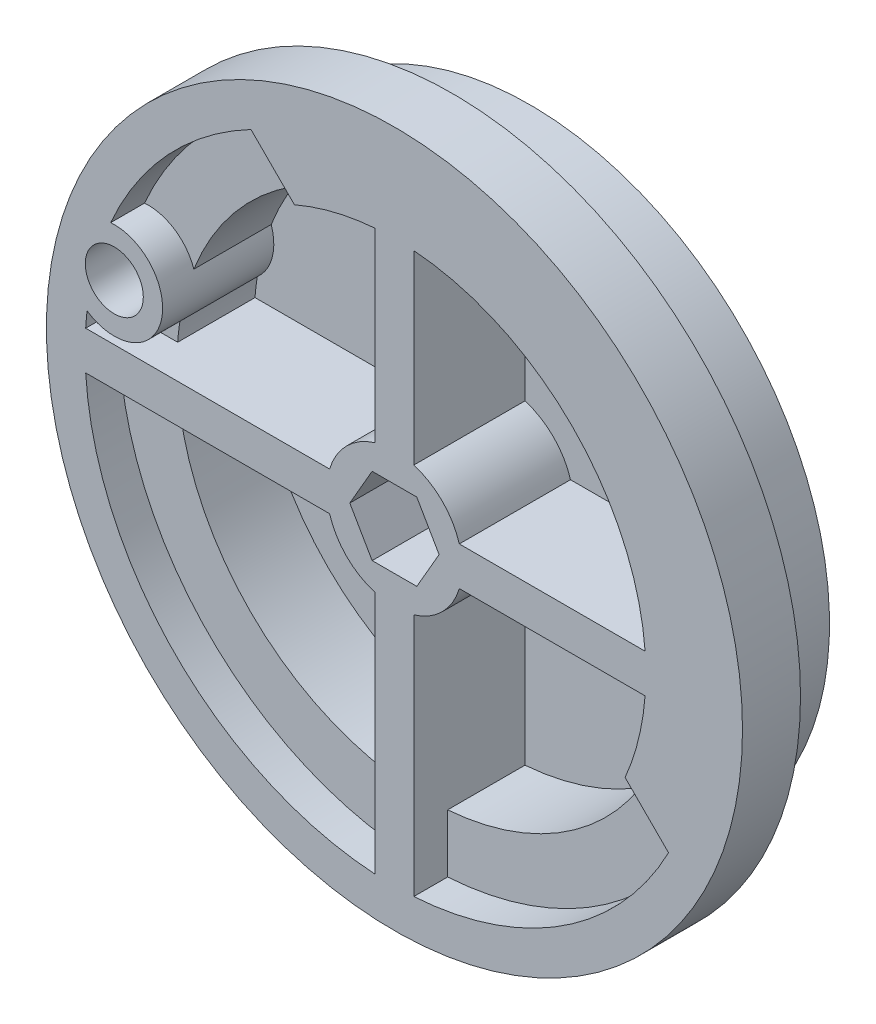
ISO-10303-21;
HEADER;
FILE_DESCRIPTION(('STEP AP214'),'2;1');
FILE_NAME('part.step','',(''),(''),'','','');
FILE_SCHEMA(('AUTOMOTIVE_DESIGN { 1 0 10303 214 1 1 1 1 }'));
ENDSEC;
DATA;
#1=APPLICATION_CONTEXT('core data for automotive mechanical design processes');
#2=APPLICATION_PROTOCOL_DEFINITION('international standard','automotive_design',2000,#1);
#3=PRODUCT_CONTEXT('',#1,'mechanical');
#4=PRODUCT('Part','Part','',(#3));
#5=PRODUCT_RELATED_PRODUCT_CATEGORY('part','',(#4));
#6=PRODUCT_DEFINITION_FORMATION('','',#4);
#7=PRODUCT_DEFINITION_CONTEXT('part definition',#1,'design');
#8=PRODUCT_DEFINITION('design','',#6,#7);
#9=PRODUCT_DEFINITION_SHAPE('','',#8);
#10=(LENGTH_UNIT() NAMED_UNIT(*) SI_UNIT(.MILLI.,.METRE.));
#11=(NAMED_UNIT(*) PLANE_ANGLE_UNIT() SI_UNIT($,.RADIAN.));
#12=(NAMED_UNIT(*) SI_UNIT($,.STERADIAN.) SOLID_ANGLE_UNIT());
#13=UNCERTAINTY_MEASURE_WITH_UNIT(LENGTH_MEASURE(1.E-05),#10,'distance_accuracy_value','');
#14=(GEOMETRIC_REPRESENTATION_CONTEXT(3) GLOBAL_UNCERTAINTY_ASSIGNED_CONTEXT((#13)) GLOBAL_UNIT_ASSIGNED_CONTEXT((#10,
#11,#12)) REPRESENTATION_CONTEXT('',''));
#15=CARTESIAN_POINT('',(0.,0.,0.));
#16=DIRECTION('',(0.,0.,1.));
#17=DIRECTION('',(1.,0.,0.));
#18=AXIS2_PLACEMENT_3D('',#15,#16,#17);
#19=CARTESIAN_POINT('',(0.,0.,4.));
#20=DIRECTION('',(0.,0.,-1.));
#21=DIRECTION('',(-1.,0.,0.));
#22=AXIS2_PLACEMENT_3D('',#19,#20,#21);
#23=CYLINDRICAL_SURFACE('',#22,15.5);
#24=DIRECTION('',(0.,0.,-1.));
#25=VECTOR('',#24,1.);
#26=CARTESIAN_POINT('',(-14.1362931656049,6.35729624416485,2.125));
#27=LINE('',#26,#25);
#28=CARTESIAN_POINT('',(-14.1362931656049,6.35729624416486,4.));
#29=VERTEX_POINT('',#28);
#30=CARTESIAN_POINT('',(-14.1362931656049,6.35729624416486,0.));
#31=VERTEX_POINT('',#30);
#32=EDGE_CURVE('E346',#29,#31,#27,.T.);
#33=ORIENTED_EDGE('',*,*,#32,.F.);
#34=CARTESIAN_POINT('',(0.,0.,4.));
#35=DIRECTION('',(0.,0.,1.));
#36=DIRECTION('',(1.,0.,0.));
#37=AXIS2_PLACEMENT_3D('',#34,#35,#36);
#38=CIRCLE('',#37,15.5);
#39=CARTESIAN_POINT('',(-15.4210371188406,1.56256653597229,4.));
#40=VERTEX_POINT('',#39);
#41=EDGE_CURVE('E552',#40,#29,#38,.T.);
#42=ORIENTED_EDGE('',*,*,#41,.F.);
#43=DIRECTION('',(0.,0.,-1.));
#44=VECTOR('',#43,1.);
#45=CARTESIAN_POINT('',(-15.4210371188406,1.5625665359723,2.125));
#46=LINE('',#45,#44);
#47=CARTESIAN_POINT('',(-15.4210371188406,1.56256653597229,0.));
#48=VERTEX_POINT('',#47);
#49=EDGE_CURVE('E343',#48,#40,#46,.F.);
#50=ORIENTED_EDGE('',*,*,#49,.F.);
#51=CARTESIAN_POINT('',(0.,0.,0.));
#52=DIRECTION('',(0.,0.,1.));
#53=DIRECTION('',(1.,0.,0.));
#54=AXIS2_PLACEMENT_3D('',#51,#52,#53);
#55=CIRCLE('',#54,15.5);
#56=EDGE_CURVE('E549',#48,#31,#55,.T.);
#57=ORIENTED_EDGE('',*,*,#56,.T.);
#58=EDGE_LOOP('',(#33,#42,#50,#57));
#59=FACE_BOUND('',#58,.T.);
#60=ADVANCED_FACE('F30',(#59),#23,.T.);
#61=CARTESIAN_POINT('',(0.,0.,0.));
#62=DIRECTION('',(0.,0.,1.));
#63=DIRECTION('',(1.,0.,0.));
#64=AXIS2_PLACEMENT_3D('',#61,#62,#63);
#65=PLANE('',#64);
#66=DIRECTION('',(-1.,0.,0.));
#67=VECTOR('',#66,1.);
#68=CARTESIAN_POINT('',(0.,2.,0.));
#69=LINE('',#68,#67);
#70=CARTESIAN_POINT('',(1.15470053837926,2.,0.));
#71=VERTEX_POINT('',#70);
#72=CARTESIAN_POINT('',(-1.15470053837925,2.,0.));
#73=VERTEX_POINT('',#72);
#74=EDGE_CURVE('E310',#71,#73,#69,.T.);
#75=ORIENTED_EDGE('',*,*,#74,.T.);
#76=DIRECTION('',(-0.499999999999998,-0.86602540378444,0.));
#77=VECTOR('',#76,1.);
#78=CARTESIAN_POINT('',(-1.73205080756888,0.999999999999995,0.));
#79=LINE('',#78,#77);
#80=CARTESIAN_POINT('',(-2.3094010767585,0.,0.));
#81=VERTEX_POINT('',#80);
#82=EDGE_CURVE('E313',#73,#81,#79,.T.);
#83=ORIENTED_EDGE('',*,*,#82,.T.);
#84=DIRECTION('',(0.499999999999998,-0.86602540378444,0.));
#85=VECTOR('',#84,1.);
#86=CARTESIAN_POINT('',(-1.73205080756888,-0.999999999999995,0.));
#87=LINE('',#86,#85);
#88=CARTESIAN_POINT('',(-1.15470053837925,-2.,0.));
#89=VERTEX_POINT('',#88);
#90=EDGE_CURVE('E295',#81,#89,#87,.T.);
#91=ORIENTED_EDGE('',*,*,#90,.T.);
#92=DIRECTION('',(1.,0.,0.));
#93=VECTOR('',#92,1.);
#94=CARTESIAN_POINT('',(0.,-2.,0.));
#95=LINE('',#94,#93);
#96=CARTESIAN_POINT('',(1.15470053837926,-2.,0.));
#97=VERTEX_POINT('',#96);
#98=EDGE_CURVE('E268',#89,#97,#95,.T.);
#99=ORIENTED_EDGE('',*,*,#98,.T.);
#100=DIRECTION('',(0.499999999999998,0.86602540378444,0.));
#101=VECTOR('',#100,1.);
#102=CARTESIAN_POINT('',(1.73205080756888,-0.999999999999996,0.));
#103=LINE('',#102,#101);
#104=CARTESIAN_POINT('',(2.3094010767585,0.,0.));
#105=VERTEX_POINT('',#104);
#106=EDGE_CURVE('E304',#97,#105,#103,.T.);
#107=ORIENTED_EDGE('',*,*,#106,.T.);
#108=DIRECTION('',(-0.499999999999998,0.86602540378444,0.));
#109=VECTOR('',#108,1.);
#110=CARTESIAN_POINT('',(1.73205080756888,0.999999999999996,0.));
#111=LINE('',#110,#109);
#112=EDGE_CURVE('E307',#105,#71,#111,.T.);
#113=ORIENTED_EDGE('',*,*,#112,.T.);
#114=EDGE_LOOP('',(#75,#83,#91,#99,#107,#113));
#115=FACE_BOUND('',#114,.T.);
#116=CARTESIAN_POINT('',(-14.488887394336,3.88228567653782,0.));
#117=DIRECTION('',(0.,0.,1.));
#118=DIRECTION('',(1.,0.,0.));
#119=AXIS2_PLACEMENT_3D('',#116,#117,#118);
#120=CIRCLE('',#119,2.5);
#121=EDGE_CURVE('E349',#31,#48,#120,.F.);
#122=ORIENTED_EDGE('',*,*,#121,.F.);
#123=ORIENTED_EDGE('',*,*,#56,.F.);
#124=EDGE_LOOP('',(#122,#123));
#125=FACE_BOUND('',#124,.T.);
#126=ADVANCED_FACE('F617',(#115,#125),#65,.F.);
#127=CARTESIAN_POINT('',(0.,0.,4.));
#128=DIRECTION('',(0.,0.,1.));
#129=DIRECTION('',(1.,0.,0.));
#130=AXIS2_PLACEMENT_3D('',#127,#128,#129);
#131=PLANE('',#130);
#132=CARTESIAN_POINT('',(0.,0.,4.));
#133=DIRECTION('',(0.,0.,1.));
#134=DIRECTION('',(1.,0.,0.));
#135=AXIS2_PLACEMENT_3D('',#132,#133,#134);
#136=CIRCLE('',#135,18.);
#137=CARTESIAN_POINT('',(18.,0.,4.));
#138=VERTEX_POINT('',#137);
#139=EDGE_CURVE('E537',#138,#138,#136,.T.);
#140=ORIENTED_EDGE('',*,*,#139,.F.);
#141=EDGE_LOOP('',(#140));
#142=FACE_BOUND('',#141,.T.);
#143=CARTESIAN_POINT('',(-14.488887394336,3.88228567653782,4.));
#144=DIRECTION('',(0.,0.,1.));
#145=DIRECTION('',(1.,0.,0.));
#146=AXIS2_PLACEMENT_3D('',#143,#144,#145);
#147=CIRCLE('',#146,2.5);
#148=EDGE_CURVE('E340',#40,#29,#147,.F.);
#149=ORIENTED_EDGE('',*,*,#148,.F.);
#150=ORIENTED_EDGE('',*,*,#41,.T.);
#151=EDGE_LOOP('',(#149,#150));
#152=FACE_BOUND('',#151,.T.);
#153=ADVANCED_FACE('F613',(#142,#152),#131,.F.);
#154=CARTESIAN_POINT('',(0.,0.,5.25));
#155=DIRECTION('',(0.,0.,1.));
#156=DIRECTION('',(1.,0.,0.));
#157=AXIS2_PLACEMENT_3D('',#154,#155,#156);
#158=CYLINDRICAL_SURFACE('',#157,16.);
#159=DIRECTION('',(0.,0.,-1.));
#160=VECTOR('',#159,1.);
#161=CARTESIAN_POINT('',(-15.8965768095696,1.81627248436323,2.125));
#162=LINE('',#161,#160);
#163=CARTESIAN_POINT('',(-15.8965768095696,1.81627248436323,7.));
#164=VERTEX_POINT('',#163);
#165=CARTESIAN_POINT('',(-15.8965768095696,1.81627248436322,5.25));
#166=VERTEX_POINT('',#165);
#167=EDGE_CURVE('E338',#164,#166,#162,.T.);
#168=ORIENTED_EDGE('',*,*,#167,.F.);
#169=CARTESIAN_POINT('',(0.,0.,7.));
#170=DIRECTION('',(0.,0.,1.));
#171=DIRECTION('',(1.,0.,0.));
#172=AXIS2_PLACEMENT_3D('',#169,#170,#171);
#173=CIRCLE('',#172,16.);
#174=CARTESIAN_POINT('',(-15.9687194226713,1.,7.));
#175=VERTEX_POINT('',#174);
#176=EDGE_CURVE('E454',#164,#175,#173,.T.);
#177=ORIENTED_EDGE('',*,*,#176,.T.);
#178=DIRECTION('',(0.,0.,1.));
#179=VECTOR('',#178,1.);
#180=CARTESIAN_POINT('',(-15.9687194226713,1.,5.25));
#181=LINE('',#180,#179);
#182=CARTESIAN_POINT('',(-15.9687194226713,1.,5.25));
#183=VERTEX_POINT('',#182);
#184=EDGE_CURVE('E475',#183,#175,#181,.T.);
#185=ORIENTED_EDGE('',*,*,#184,.F.);
#186=CARTESIAN_POINT('',(0.,0.,5.25));
#187=DIRECTION('',(0.,0.,1.));
#188=DIRECTION('',(1.,0.,0.));
#189=AXIS2_PLACEMENT_3D('',#186,#187,#188);
#190=CIRCLE('',#189,16.);
#191=EDGE_CURVE('E464',#166,#183,#190,.T.);
#192=ORIENTED_EDGE('',*,*,#191,.F.);
#193=EDGE_LOOP('',(#168,#177,#185,#192));
#194=FACE_BOUND('',#193,.T.);
#195=ADVANCED_FACE('F575',(#194),#158,.F.);
#196=DIRECTION('',(0.,0.,-1.));
#197=VECTOR('',#196,1.);
#198=CARTESIAN_POINT('',(-14.6749755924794,6.37535029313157,2.125));
#199=LINE('',#198,#197);
#200=CARTESIAN_POINT('',(-14.6749755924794,6.37535029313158,5.25));
#201=VERTEX_POINT('',#200);
#202=CARTESIAN_POINT('',(-14.6749755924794,6.37535029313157,7.));
#203=VERTEX_POINT('',#202);
#204=EDGE_CURVE('E336',#201,#203,#199,.F.);
#205=ORIENTED_EDGE('',*,*,#204,.F.);
#206=CARTESIAN_POINT('',(-7.42049941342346,14.175196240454,5.25));
#207=VERTEX_POINT('',#206);
#208=EDGE_CURVE('E465',#207,#201,#190,.T.);
#209=ORIENTED_EDGE('',*,*,#208,.F.);
#210=DIRECTION('',(0.,0.,1.));
#211=VECTOR('',#210,1.);
#212=CARTESIAN_POINT('',(-7.42049941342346,14.175196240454,5.25));
#213=LINE('',#212,#211);
#214=CARTESIAN_POINT('',(-7.42049941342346,14.175196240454,7.));
#215=VERTEX_POINT('',#214);
#216=EDGE_CURVE('E478',#207,#215,#213,.T.);
#217=ORIENTED_EDGE('',*,*,#216,.T.);
#218=EDGE_CURVE('E455',#215,#203,#173,.T.);
#219=ORIENTED_EDGE('',*,*,#218,.T.);
#220=EDGE_LOOP('',(#205,#209,#217,#219));
#221=FACE_BOUND('',#220,.T.);
#222=ADVANCED_FACE('F605',(#221),#158,.F.);
#223=CARTESIAN_POINT('',(0.,0.,5.25));
#224=DIRECTION('',(0.,0.,1.));
#225=DIRECTION('',(1.,0.,0.));
#226=AXIS2_PLACEMENT_3D('',#223,#224,#225);
#227=CYLINDRICAL_SURFACE('',#226,13.);
#228=DIRECTION('',(0.,0.,-1.));
#229=VECTOR('',#228,1.);
#230=CARTESIAN_POINT('',(-12.8454907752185,1.99834099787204,2.125));
#231=LINE('',#230,#229);
#232=CARTESIAN_POINT('',(-12.8454907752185,1.99834099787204,5.25));
#233=VERTEX_POINT('',#232);
#234=CARTESIAN_POINT('',(-12.8454907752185,1.99834099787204,1.25));
#235=VERTEX_POINT('',#234);
#236=EDGE_CURVE('E330',#233,#235,#231,.T.);
#237=ORIENTED_EDGE('',*,*,#236,.F.);
#238=CARTESIAN_POINT('',(0.,0.,5.25));
#239=DIRECTION('',(0.,0.,1.));
#240=DIRECTION('',(1.,0.,0.));
#241=AXIS2_PLACEMENT_3D('',#238,#239,#240);
#242=CIRCLE('',#241,13.);
#243=CARTESIAN_POINT('',(-12.9614813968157,1.,5.25));
#244=VERTEX_POINT('',#243);
#245=EDGE_CURVE('E553',#233,#244,#242,.T.);
#246=ORIENTED_EDGE('',*,*,#245,.T.);
#247=DIRECTION('',(0.,0.,1.));
#248=VECTOR('',#247,1.);
#249=CARTESIAN_POINT('',(-12.9614813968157,1.,1.25));
#250=LINE('',#249,#248);
#251=CARTESIAN_POINT('',(-12.9614813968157,1.,1.25));
#252=VERTEX_POINT('',#251);
#253=EDGE_CURVE('E412',#252,#244,#250,.T.);
#254=ORIENTED_EDGE('',*,*,#253,.F.);
#255=CARTESIAN_POINT('',(0.,0.,1.25));
#256=DIRECTION('',(0.,0.,1.));
#257=DIRECTION('',(1.,0.,0.));
#258=AXIS2_PLACEMENT_3D('',#255,#256,#257);
#259=CIRCLE('',#258,13.);
#260=EDGE_CURVE('E405',#235,#252,#259,.T.);
#261=ORIENTED_EDGE('',*,*,#260,.F.);
#262=EDGE_LOOP('',(#237,#246,#254,#261));
#263=FACE_BOUND('',#262,.T.);
#264=ADVANCED_FACE('F562',(#263),#227,.F.);
#265=DIRECTION('',(0.,0.,-1.));
#266=VECTOR('',#265,1.);
#267=CARTESIAN_POINT('',(-12.1236918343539,4.69213131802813,2.125));
#268=LINE('',#267,#266);
#269=CARTESIAN_POINT('',(-12.1236918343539,4.69213131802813,1.25));
#270=VERTEX_POINT('',#269);
#271=CARTESIAN_POINT('',(-12.1236918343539,4.69213131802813,5.25));
#272=VERTEX_POINT('',#271);
#273=EDGE_CURVE('E328',#270,#272,#268,.F.);
#274=ORIENTED_EDGE('',*,*,#273,.F.);
#275=CARTESIAN_POINT('',(-1.,12.9614813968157,1.25));
#276=VERTEX_POINT('',#275);
#277=EDGE_CURVE('E406',#276,#270,#259,.T.);
#278=ORIENTED_EDGE('',*,*,#277,.F.);
#279=DIRECTION('',(0.,0.,1.));
#280=VECTOR('',#279,1.);
#281=CARTESIAN_POINT('',(-1.,12.9614813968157,5.25));
#282=LINE('',#281,#280);
#283=CARTESIAN_POINT('',(-1.,12.9614813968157,7.));
#284=VERTEX_POINT('',#283);
#285=EDGE_CURVE('E482',#276,#284,#282,.T.);
#286=ORIENTED_EDGE('',*,*,#285,.T.);
#287=CARTESIAN_POINT('',(0.,0.,7.));
#288=DIRECTION('',(0.,0.,1.));
#289=DIRECTION('',(-1.,0.,0.));
#290=AXIS2_PLACEMENT_3D('',#287,#288,#289);
#291=CIRCLE('',#290,13.);
#292=CARTESIAN_POINT('',(-5.17212628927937,11.9268231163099,7.));
#293=VERTEX_POINT('',#292);
#294=EDGE_CURVE('E448',#284,#293,#291,.T.);
#295=ORIENTED_EDGE('',*,*,#294,.T.);
#296=DIRECTION('',(0.,0.,1.));
#297=VECTOR('',#296,1.);
#298=CARTESIAN_POINT('',(-5.17212628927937,11.9268231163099,5.25));
#299=LINE('',#298,#297);
#300=CARTESIAN_POINT('',(-5.17212628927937,11.9268231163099,5.25));
#301=VERTEX_POINT('',#300);
#302=EDGE_CURVE('E480',#301,#293,#299,.T.);
#303=ORIENTED_EDGE('',*,*,#302,.F.);
#304=EDGE_CURVE('E37',#301,#272,#242,.T.);
#305=ORIENTED_EDGE('',*,*,#304,.T.);
#306=EDGE_LOOP('',(#274,#278,#286,#295,#303,#305));
#307=FACE_BOUND('',#306,.T.);
#308=ADVANCED_FACE('F594',(#307),#227,.F.);
#309=CARTESIAN_POINT('',(0.,0.,5.25));
#310=DIRECTION('',(0.,0.,1.));
#311=DIRECTION('',(1.,0.,0.));
#312=AXIS2_PLACEMENT_3D('',#309,#310,#311);
#313=PLANE('',#312);
#314=ORIENTED_EDGE('',*,*,#245,.F.);
#315=CARTESIAN_POINT('',(-14.488887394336,3.88228567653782,5.25));
#316=DIRECTION('',(0.,0.,1.));
#317=DIRECTION('',(1.,0.,0.));
#318=AXIS2_PLACEMENT_3D('',#315,#316,#317);
#319=CIRCLE('',#318,2.5);
#320=EDGE_CURVE('E335',#233,#166,#319,.F.);
#321=ORIENTED_EDGE('',*,*,#320,.T.);
#322=ORIENTED_EDGE('',*,*,#191,.T.);
#323=DIRECTION('',(1.,0.,0.));
#324=VECTOR('',#323,1.);
#325=CARTESIAN_POINT('',(-15.9687194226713,1.,5.25));
#326=LINE('',#325,#324);
#327=EDGE_CURVE('E468',#183,#244,#326,.T.);
#328=ORIENTED_EDGE('',*,*,#327,.T.);
#329=EDGE_LOOP('',(#314,#321,#322,#328));
#330=FACE_BOUND('',#329,.T.);
#331=ADVANCED_FACE('F570',(#330),#313,.T.);
#332=ORIENTED_EDGE('',*,*,#208,.T.);
#333=EDGE_CURVE('E332',#201,#272,#319,.F.);
#334=ORIENTED_EDGE('',*,*,#333,.T.);
#335=ORIENTED_EDGE('',*,*,#304,.F.);
#336=DIRECTION('',(-0.707106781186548,0.707106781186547,0.));
#337=VECTOR('',#336,1.);
#338=CARTESIAN_POINT('',(-5.17212628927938,11.9268231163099,5.25));
#339=LINE('',#338,#337);
#340=EDGE_CURVE('E461',#301,#207,#339,.T.);
#341=ORIENTED_EDGE('',*,*,#340,.T.);
#342=EDGE_LOOP('',(#332,#334,#335,#341));
#343=FACE_BOUND('',#342,.T.);
#344=ADVANCED_FACE('F602',(#343),#313,.T.);
#345=CARTESIAN_POINT('',(0.,0.,1.25));
#346=DIRECTION('',(0.,0.,1.));
#347=DIRECTION('',(1.,0.,0.));
#348=AXIS2_PLACEMENT_3D('',#345,#346,#347);
#349=PLANE('',#348);
#350=ORIENTED_EDGE('',*,*,#277,.T.);
#351=CARTESIAN_POINT('',(-14.488887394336,3.88228567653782,1.25));
#352=DIRECTION('',(0.,0.,1.));
#353=DIRECTION('',(1.,0.,0.));
#354=AXIS2_PLACEMENT_3D('',#351,#352,#353);
#355=CIRCLE('',#354,2.5);
#356=EDGE_CURVE('E11',#270,#235,#355,.F.);
#357=ORIENTED_EDGE('',*,*,#356,.T.);
#358=ORIENTED_EDGE('',*,*,#260,.T.);
#359=DIRECTION('',(1.,0.,0.));
#360=VECTOR('',#359,1.);
#361=CARTESIAN_POINT('',(-12.9614813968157,1.,1.25));
#362=LINE('',#361,#360);
#363=CARTESIAN_POINT('',(-3.35410196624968,1.,1.25));
#364=VERTEX_POINT('',#363);
#365=EDGE_CURVE('E409',#252,#364,#362,.T.);
#366=ORIENTED_EDGE('',*,*,#365,.T.);
#367=CARTESIAN_POINT('',(0.,0.,1.25));
#368=DIRECTION('',(0.,0.,-1.));
#369=DIRECTION('',(1.,0.,0.));
#370=AXIS2_PLACEMENT_3D('',#367,#368,#369);
#371=CIRCLE('',#370,3.5);
#372=CARTESIAN_POINT('',(-1.,3.35410196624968,1.25));
#373=VERTEX_POINT('',#372);
#374=EDGE_CURVE('E399',#364,#373,#371,.T.);
#375=ORIENTED_EDGE('',*,*,#374,.T.);
#376=DIRECTION('',(0.,1.,0.));
#377=VECTOR('',#376,1.);
#378=CARTESIAN_POINT('',(-1.,3.35410196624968,1.25));
#379=LINE('',#378,#377);
#380=EDGE_CURVE('E402',#373,#276,#379,.T.);
#381=ORIENTED_EDGE('',*,*,#380,.T.);
#382=EDGE_LOOP('',(#350,#357,#358,#366,#375,#381));
#383=FACE_BOUND('',#382,.T.);
#384=ADVANCED_FACE('F591',(#383),#349,.T.);
#385=CARTESIAN_POINT('',(0.,0.,7.));
#386=DIRECTION('',(0.,0.,-1.));
#387=DIRECTION('',(-1.,0.,0.));
#388=AXIS2_PLACEMENT_3D('',#385,#386,#387);
#389=CYLINDRICAL_SURFACE('',#388,18.);
#390=CARTESIAN_POINT('',(0.,0.,7.));
#391=DIRECTION('',(0.,0.,1.));
#392=DIRECTION('',(1.,0.,0.));
#393=AXIS2_PLACEMENT_3D('',#390,#391,#392);
#394=CIRCLE('',#393,18.);
#395=CARTESIAN_POINT('',(18.,0.,7.));
#396=VERTEX_POINT('',#395);
#397=EDGE_CURVE('E546',#396,#396,#394,.T.);
#398=ORIENTED_EDGE('',*,*,#397,.F.);
#399=EDGE_LOOP('',(#398));
#400=FACE_BOUND('',#399,.T.);
#401=ORIENTED_EDGE('',*,*,#139,.T.);
#402=EDGE_LOOP('',(#401));
#403=FACE_BOUND('',#402,.T.);
#404=ADVANCED_FACE('F641',(#400,#403),#389,.T.);
#405=CARTESIAN_POINT('',(0.,0.,7.));
#406=DIRECTION('',(0.,0.,1.));
#407=DIRECTION('',(1.,0.,0.));
#408=AXIS2_PLACEMENT_3D('',#405,#406,#407);
#409=PLANE('',#408);
#410=DIRECTION('',(-0.499999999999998,-0.86602540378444,0.));
#411=VECTOR('',#410,1.);
#412=CARTESIAN_POINT('',(-1.15470053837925,2.,7.));
#413=LINE('',#412,#411);
#414=CARTESIAN_POINT('',(-1.15470053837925,2.,7.));
#415=VERTEX_POINT('',#414);
#416=CARTESIAN_POINT('',(-2.3094010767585,0.,7.));
#417=VERTEX_POINT('',#416);
#418=EDGE_CURVE('E52',#415,#417,#413,.T.);
#419=ORIENTED_EDGE('',*,*,#418,.F.);
#420=DIRECTION('',(-1.,0.,0.));
#421=VECTOR('',#420,1.);
#422=CARTESIAN_POINT('',(-1.15470053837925,2.,7.));
#423=LINE('',#422,#421);
#424=CARTESIAN_POINT('',(1.15470053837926,2.,7.));
#425=VERTEX_POINT('',#424);
#426=EDGE_CURVE('E290',#425,#415,#423,.T.);
#427=ORIENTED_EDGE('',*,*,#426,.F.);
#428=DIRECTION('',(-0.499999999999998,0.86602540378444,0.));
#429=VECTOR('',#428,1.);
#430=CARTESIAN_POINT('',(1.15470053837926,2.,7.));
#431=LINE('',#430,#429);
#432=CARTESIAN_POINT('',(2.3094010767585,0.,7.));
#433=VERTEX_POINT('',#432);
#434=EDGE_CURVE('E284',#433,#425,#431,.T.);
#435=ORIENTED_EDGE('',*,*,#434,.F.);
#436=DIRECTION('',(0.499999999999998,0.86602540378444,0.));
#437=VECTOR('',#436,1.);
#438=CARTESIAN_POINT('',(1.15470053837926,-2.,7.));
#439=LINE('',#438,#437);
#440=CARTESIAN_POINT('',(1.15470053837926,-2.,7.));
#441=VERTEX_POINT('',#440);
#442=EDGE_CURVE('E282',#441,#433,#439,.T.);
#443=ORIENTED_EDGE('',*,*,#442,.F.);
#444=DIRECTION('',(1.,0.,0.));
#445=VECTOR('',#444,1.);
#446=CARTESIAN_POINT('',(-1.15470053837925,-2.,7.));
#447=LINE('',#446,#445);
#448=CARTESIAN_POINT('',(-1.15470053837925,-2.,7.));
#449=VERTEX_POINT('',#448);
#450=EDGE_CURVE('E265',#449,#441,#447,.T.);
#451=ORIENTED_EDGE('',*,*,#450,.F.);
#452=DIRECTION('',(0.499999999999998,-0.86602540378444,0.));
#453=VECTOR('',#452,1.);
#454=CARTESIAN_POINT('',(-1.15470053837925,-2.,7.));
#455=LINE('',#454,#453);
#456=EDGE_CURVE('E274',#417,#449,#455,.T.);
#457=ORIENTED_EDGE('',*,*,#456,.F.);
#458=EDGE_LOOP('',(#419,#427,#435,#443,#451,#457));
#459=FACE_BOUND('',#458,.T.);
#460=CARTESIAN_POINT('',(-14.488887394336,3.88228567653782,7.));
#461=DIRECTION('',(0.,0.,1.));
#462=DIRECTION('',(1.,0.,0.));
#463=AXIS2_PLACEMENT_3D('',#460,#461,#462);
#464=CIRCLE('',#463,1.5);
#465=CARTESIAN_POINT('',(-12.988887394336,3.88228567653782,7.));
#466=VERTEX_POINT('',#465);
#467=EDGE_CURVE('E316',#466,#466,#464,.T.);
#468=ORIENTED_EDGE('',*,*,#467,.F.);
#469=EDGE_LOOP('',(#468));
#470=FACE_BOUND('',#469,.T.);
#471=CARTESIAN_POINT('',(-14.488887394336,3.88228567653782,7.));
#472=DIRECTION('',(0.,0.,1.));
#473=DIRECTION('',(1.,0.,0.));
#474=AXIS2_PLACEMENT_3D('',#471,#472,#473);
#475=CIRCLE('',#474,2.5);
#476=EDGE_CURVE('E325',#164,#203,#475,.T.);
#477=ORIENTED_EDGE('',*,*,#476,.T.);
#478=ORIENTED_EDGE('',*,*,#218,.F.);
#479=DIRECTION('',(-0.707106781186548,0.707106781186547,0.));
#480=VECTOR('',#479,1.);
#481=CARTESIAN_POINT('',(-5.17212628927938,11.9268231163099,7.));
#482=LINE('',#481,#480);
#483=EDGE_CURVE('E451',#293,#215,#482,.T.);
#484=ORIENTED_EDGE('',*,*,#483,.F.);
#485=ORIENTED_EDGE('',*,*,#294,.F.);
#486=DIRECTION('',(0.,1.,0.));
#487=VECTOR('',#486,1.);
#488=CARTESIAN_POINT('',(-1.,12.9614813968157,7.));
#489=LINE('',#488,#487);
#490=CARTESIAN_POINT('',(-1.,3.35410196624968,7.));
#491=VERTEX_POINT('',#490);
#492=EDGE_CURVE('E445',#491,#284,#489,.T.);
#493=ORIENTED_EDGE('',*,*,#492,.F.);
#494=CARTESIAN_POINT('',(0.,0.,7.));
#495=DIRECTION('',(0.,0.,-1.));
#496=DIRECTION('',(1.,0.,0.));
#497=AXIS2_PLACEMENT_3D('',#494,#495,#496);
#498=CIRCLE('',#497,3.5);
#499=CARTESIAN_POINT('',(-3.35410196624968,1.,7.));
#500=VERTEX_POINT('',#499);
#501=EDGE_CURVE('E437',#500,#491,#498,.T.);
#502=ORIENTED_EDGE('',*,*,#501,.F.);
#503=DIRECTION('',(1.,0.,0.));
#504=VECTOR('',#503,1.);
#505=CARTESIAN_POINT('',(-15.9687194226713,1.,7.));
#506=LINE('',#505,#504);
#507=EDGE_CURVE('E458',#175,#500,#506,.T.);
#508=ORIENTED_EDGE('',*,*,#507,.F.);
#509=ORIENTED_EDGE('',*,*,#176,.F.);
#510=EDGE_LOOP('',(#477,#478,#484,#485,#493,#502,#508,#509));
#511=FACE_BOUND('',#510,.T.);
#512=ORIENTED_EDGE('',*,*,#397,.T.);
#513=EDGE_LOOP('',(#512));
#514=FACE_BOUND('',#513,.T.);
#515=CARTESIAN_POINT('',(0.,0.,7.));
#516=DIRECTION('',(0.,0.,1.));
#517=DIRECTION('',(-1.,0.,0.));
#518=AXIS2_PLACEMENT_3D('',#515,#516,#517);
#519=CIRCLE('',#518,13.);
#520=CARTESIAN_POINT('',(12.9614813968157,1.,7.));
#521=VERTEX_POINT('',#520);
#522=CARTESIAN_POINT('',(1.,12.9614813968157,7.));
#523=VERTEX_POINT('',#522);
#524=EDGE_CURVE('E513',#521,#523,#519,.T.);
#525=ORIENTED_EDGE('',*,*,#524,.F.);
#526=DIRECTION('',(1.,0.,0.));
#527=VECTOR('',#526,1.);
#528=CARTESIAN_POINT('',(12.9614813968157,1.,7.));
#529=LINE('',#528,#527);
#530=CARTESIAN_POINT('',(3.35410196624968,1.,7.));
#531=VERTEX_POINT('',#530);
#532=EDGE_CURVE('E531',#531,#521,#529,.T.);
#533=ORIENTED_EDGE('',*,*,#532,.F.);
#534=CARTESIAN_POINT('',(0.,0.,7.));
#535=DIRECTION('',(0.,0.,-1.));
#536=DIRECTION('',(-1.,0.,0.));
#537=AXIS2_PLACEMENT_3D('',#534,#535,#536);
#538=CIRCLE('',#537,3.5);
#539=CARTESIAN_POINT('',(1.,3.35410196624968,7.));
#540=VERTEX_POINT('',#539);
#541=EDGE_CURVE('E528',#540,#531,#538,.T.);
#542=ORIENTED_EDGE('',*,*,#541,.F.);
#543=DIRECTION('',(0.,-1.,0.));
#544=VECTOR('',#543,1.);
#545=CARTESIAN_POINT('',(1.,12.9614813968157,7.));
#546=LINE('',#545,#544);
#547=EDGE_CURVE('E525',#523,#540,#546,.T.);
#548=ORIENTED_EDGE('',*,*,#547,.F.);
#549=EDGE_LOOP('',(#525,#533,#542,#548));
#550=FACE_BOUND('',#549,.T.);
#551=CARTESIAN_POINT('',(0.,0.,7.));
#552=DIRECTION('',(0.,0.,1.));
#553=DIRECTION('',(-1.,0.,0.));
#554=AXIS2_PLACEMENT_3D('',#551,#552,#553);
#555=CIRCLE('',#554,13.);
#556=CARTESIAN_POINT('',(11.9268231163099,-5.17212628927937,7.));
#557=VERTEX_POINT('',#556);
#558=CARTESIAN_POINT('',(12.9614813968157,-1.,7.));
#559=VERTEX_POINT('',#558);
#560=EDGE_CURVE('E474',#557,#559,#555,.T.);
#561=ORIENTED_EDGE('',*,*,#560,.F.);
#562=DIRECTION('',(-0.707106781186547,0.707106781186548,0.));
#563=VECTOR('',#562,1.);
#564=CARTESIAN_POINT('',(14.175196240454,-7.42049941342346,7.));
#565=LINE('',#564,#563);
#566=CARTESIAN_POINT('',(14.175196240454,-7.42049941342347,7.));
#567=VERTEX_POINT('',#566);
#568=EDGE_CURVE('E499',#567,#557,#565,.T.);
#569=ORIENTED_EDGE('',*,*,#568,.F.);
#570=CARTESIAN_POINT('',(0.,0.,7.));
#571=DIRECTION('',(0.,0.,1.));
#572=DIRECTION('',(1.,0.,0.));
#573=AXIS2_PLACEMENT_3D('',#570,#571,#572);
#574=CIRCLE('',#573,16.);
#575=CARTESIAN_POINT('',(1.,-15.9687194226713,7.));
#576=VERTEX_POINT('',#575);
#577=EDGE_CURVE('E496',#576,#567,#574,.T.);
#578=ORIENTED_EDGE('',*,*,#577,.F.);
#579=DIRECTION('',(0.,-1.,0.));
#580=VECTOR('',#579,1.);
#581=CARTESIAN_POINT('',(1.,-15.9687194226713,7.));
#582=LINE('',#581,#580);
#583=CARTESIAN_POINT('',(1.,-3.35410196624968,7.));
#584=VERTEX_POINT('',#583);
#585=EDGE_CURVE('E493',#584,#576,#582,.T.);
#586=ORIENTED_EDGE('',*,*,#585,.F.);
#587=CARTESIAN_POINT('',(0.,0.,7.));
#588=DIRECTION('',(0.,0.,-1.));
#589=DIRECTION('',(1.,0.,0.));
#590=AXIS2_PLACEMENT_3D('',#587,#588,#589);
#591=CIRCLE('',#590,3.5);
#592=CARTESIAN_POINT('',(3.35410196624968,-1.,7.));
#593=VERTEX_POINT('',#592);
#594=EDGE_CURVE('E490',#593,#584,#591,.T.);
#595=ORIENTED_EDGE('',*,*,#594,.F.);
#596=DIRECTION('',(-1.,0.,0.));
#597=VECTOR('',#596,1.);
#598=CARTESIAN_POINT('',(12.9614813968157,-1.,7.));
#599=LINE('',#598,#597);
#600=EDGE_CURVE('E487',#559,#593,#599,.T.);
#601=ORIENTED_EDGE('',*,*,#600,.F.);
#602=EDGE_LOOP('',(#561,#569,#578,#586,#595,#601));
#603=FACE_BOUND('',#602,.T.);
#604=CARTESIAN_POINT('',(0.,0.,7.));
#605=DIRECTION('',(0.,0.,1.));
#606=DIRECTION('',(-1.,0.,0.));
#607=AXIS2_PLACEMENT_3D('',#604,#605,#606);
#608=CIRCLE('',#607,16.);
#609=CARTESIAN_POINT('',(-15.9687194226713,-1.,7.));
#610=VERTEX_POINT('',#609);
#611=CARTESIAN_POINT('',(-1.,-15.9687194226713,7.));
#612=VERTEX_POINT('',#611);
#613=EDGE_CURVE('E415',#610,#612,#608,.T.);
#614=ORIENTED_EDGE('',*,*,#613,.F.);
#615=DIRECTION('',(-1.,0.,0.));
#616=VECTOR('',#615,1.);
#617=CARTESIAN_POINT('',(-15.9687194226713,-1.,7.));
#618=LINE('',#617,#616);
#619=CARTESIAN_POINT('',(-3.35410196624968,-1.,7.));
#620=VERTEX_POINT('',#619);
#621=EDGE_CURVE('E423',#620,#610,#618,.T.);
#622=ORIENTED_EDGE('',*,*,#621,.F.);
#623=CARTESIAN_POINT('',(0.,0.,7.));
#624=DIRECTION('',(0.,0.,-1.));
#625=DIRECTION('',(-1.,0.,0.));
#626=AXIS2_PLACEMENT_3D('',#623,#624,#625);
#627=CIRCLE('',#626,3.5);
#628=CARTESIAN_POINT('',(-1.,-3.35410196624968,7.));
#629=VERTEX_POINT('',#628);
#630=EDGE_CURVE('E420',#629,#620,#627,.T.);
#631=ORIENTED_EDGE('',*,*,#630,.F.);
#632=DIRECTION('',(0.,1.,0.));
#633=VECTOR('',#632,1.);
#634=CARTESIAN_POINT('',(-1.,-15.9687194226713,7.));
#635=LINE('',#634,#633);
#636=EDGE_CURVE('E417',#612,#629,#635,.T.);
#637=ORIENTED_EDGE('',*,*,#636,.F.);
#638=EDGE_LOOP('',(#614,#622,#631,#637));
#639=FACE_BOUND('',#638,.T.);
#640=ADVANCED_FACE('F278',(#459,#470,#511,#514,#550,#603,#639),#409,.T.);
#641=CARTESIAN_POINT('',(0.,0.,5.25));
#642=DIRECTION('',(0.,0.,1.));
#643=DIRECTION('',(1.,0.,0.));
#644=AXIS2_PLACEMENT_3D('',#641,#642,#643);
#645=CYLINDRICAL_SURFACE('',#644,13.);
#646=ORIENTED_EDGE('',*,*,#524,.T.);
#647=DIRECTION('',(0.,0.,1.));
#648=VECTOR('',#647,1.);
#649=CARTESIAN_POINT('',(1.,12.9614813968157,5.25));
#650=LINE('',#649,#648);
#651=CARTESIAN_POINT('',(1.,12.9614813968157,1.25));
#652=VERTEX_POINT('',#651);
#653=EDGE_CURVE('E534',#652,#523,#650,.T.);
#654=ORIENTED_EDGE('',*,*,#653,.F.);
#655=CARTESIAN_POINT('',(0.,0.,1.25));
#656=DIRECTION('',(0.,0.,1.));
#657=DIRECTION('',(-1.,0.,0.));
#658=AXIS2_PLACEMENT_3D('',#655,#656,#657);
#659=CIRCLE('',#658,13.);
#660=CARTESIAN_POINT('',(12.9614813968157,1.,1.25));
#661=VERTEX_POINT('',#660);
#662=EDGE_CURVE('E387',#661,#652,#659,.T.);
#663=ORIENTED_EDGE('',*,*,#662,.F.);
#664=DIRECTION('',(0.,0.,1.));
#665=VECTOR('',#664,1.);
#666=CARTESIAN_POINT('',(12.9614813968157,1.,5.25));
#667=LINE('',#666,#665);
#668=EDGE_CURVE('E535',#661,#521,#667,.T.);
#669=ORIENTED_EDGE('',*,*,#668,.T.);
#670=EDGE_LOOP('',(#646,#654,#663,#669));
#671=FACE_BOUND('',#670,.T.);
#672=ADVANCED_FACE('F637',(#671),#645,.F.);
#673=CARTESIAN_POINT('',(12.9614813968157,1.,5.25));
#674=DIRECTION('',(0.,-1.,0.));
#675=DIRECTION('',(1.,0.,0.));
#676=AXIS2_PLACEMENT_3D('',#673,#674,#675);
#677=PLANE('',#676);
#678=ORIENTED_EDGE('',*,*,#532,.T.);
#679=ORIENTED_EDGE('',*,*,#668,.F.);
#680=DIRECTION('',(1.,0.,0.));
#681=VECTOR('',#680,1.);
#682=CARTESIAN_POINT('',(12.9614813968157,1.,1.25));
#683=LINE('',#682,#681);
#684=CARTESIAN_POINT('',(3.35410196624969,1.,1.25));
#685=VERTEX_POINT('',#684);
#686=EDGE_CURVE('E396',#685,#661,#683,.T.);
#687=ORIENTED_EDGE('',*,*,#686,.F.);
#688=DIRECTION('',(0.,0.,1.));
#689=VECTOR('',#688,1.);
#690=CARTESIAN_POINT('',(3.35410196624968,1.,5.25));
#691=LINE('',#690,#689);
#692=EDGE_CURVE('E538',#685,#531,#691,.T.);
#693=ORIENTED_EDGE('',*,*,#692,.T.);
#694=EDGE_LOOP('',(#678,#679,#687,#693));
#695=FACE_BOUND('',#694,.T.);
#696=ADVANCED_FACE('F752',(#695),#677,.F.);
#697=CARTESIAN_POINT('',(0.,0.,5.25));
#698=DIRECTION('',(0.,0.,1.));
#699=DIRECTION('',(1.,0.,0.));
#700=AXIS2_PLACEMENT_3D('',#697,#698,#699);
#701=CYLINDRICAL_SURFACE('',#700,3.5);
#702=ORIENTED_EDGE('',*,*,#541,.T.);
#703=ORIENTED_EDGE('',*,*,#692,.F.);
#704=CARTESIAN_POINT('',(0.,0.,1.25));
#705=DIRECTION('',(0.,0.,-1.));
#706=DIRECTION('',(-1.,0.,0.));
#707=AXIS2_PLACEMENT_3D('',#704,#705,#706);
#708=CIRCLE('',#707,3.5);
#709=CARTESIAN_POINT('',(1.,3.35410196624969,1.25));
#710=VERTEX_POINT('',#709);
#711=EDGE_CURVE('E393',#710,#685,#708,.T.);
#712=ORIENTED_EDGE('',*,*,#711,.F.);
#713=DIRECTION('',(0.,0.,1.));
#714=VECTOR('',#713,1.);
#715=CARTESIAN_POINT('',(1.,3.35410196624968,5.25));
#716=LINE('',#715,#714);
#717=EDGE_CURVE('E540',#710,#540,#716,.T.);
#718=ORIENTED_EDGE('',*,*,#717,.T.);
#719=EDGE_LOOP('',(#702,#703,#712,#718));
#720=FACE_BOUND('',#719,.T.);
#721=ADVANCED_FACE('F755',(#720),#701,.T.);
#722=CARTESIAN_POINT('',(1.,12.9614813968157,5.25));
#723=DIRECTION('',(-1.,0.,0.));
#724=DIRECTION('',(0.,-1.,0.));
#725=AXIS2_PLACEMENT_3D('',#722,#723,#724);
#726=PLANE('',#725);
#727=ORIENTED_EDGE('',*,*,#547,.T.);
#728=ORIENTED_EDGE('',*,*,#717,.F.);
#729=DIRECTION('',(0.,-1.,0.));
#730=VECTOR('',#729,1.);
#731=CARTESIAN_POINT('',(1.,3.35410196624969,1.25));
#732=LINE('',#731,#730);
#733=EDGE_CURVE('E390',#652,#710,#732,.T.);
#734=ORIENTED_EDGE('',*,*,#733,.F.);
#735=ORIENTED_EDGE('',*,*,#653,.T.);
#736=EDGE_LOOP('',(#727,#728,#734,#735));
#737=FACE_BOUND('',#736,.T.);
#738=ADVANCED_FACE('F750',(#737),#726,.F.);
#739=CARTESIAN_POINT('',(0.,0.,5.25));
#740=DIRECTION('',(0.,0.,1.));
#741=DIRECTION('',(1.,0.,0.));
#742=AXIS2_PLACEMENT_3D('',#739,#740,#741);
#743=CYLINDRICAL_SURFACE('',#742,13.);
#744=ORIENTED_EDGE('',*,*,#560,.T.);
#745=DIRECTION('',(0.,0.,1.));
#746=VECTOR('',#745,1.);
#747=CARTESIAN_POINT('',(12.9614813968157,-1.,5.25));
#748=LINE('',#747,#746);
#749=CARTESIAN_POINT('',(12.9614813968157,-1.00000000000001,1.25));
#750=VERTEX_POINT('',#749);
#751=EDGE_CURVE('E510',#750,#559,#748,.T.);
#752=ORIENTED_EDGE('',*,*,#751,.F.);
#753=CARTESIAN_POINT('',(0.,0.,1.25));
#754=DIRECTION('',(0.,0.,1.));
#755=DIRECTION('',(1.,0.,0.));
#756=AXIS2_PLACEMENT_3D('',#753,#754,#755);
#757=CIRCLE('',#756,13.);
#758=CARTESIAN_POINT('',(1.,-12.9614813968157,1.25));
#759=VERTEX_POINT('',#758);
#760=EDGE_CURVE('E379',#759,#750,#757,.T.);
#761=ORIENTED_EDGE('',*,*,#760,.F.);
#762=DIRECTION('',(0.,0.,1.));
#763=VECTOR('',#762,1.);
#764=CARTESIAN_POINT('',(1.,-12.9614813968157,1.25));
#765=LINE('',#764,#763);
#766=CARTESIAN_POINT('',(1.,-12.9614813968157,5.25));
#767=VERTEX_POINT('',#766);
#768=EDGE_CURVE('E385',#759,#767,#765,.T.);
#769=ORIENTED_EDGE('',*,*,#768,.T.);
#770=CARTESIAN_POINT('',(0.,0.,5.25));
#771=DIRECTION('',(0.,0.,1.));
#772=DIRECTION('',(1.,0.,0.));
#773=AXIS2_PLACEMENT_3D('',#770,#771,#772);
#774=CIRCLE('',#773,13.);
#775=CARTESIAN_POINT('',(11.9268231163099,-5.17212628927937,5.25));
#776=VERTEX_POINT('',#775);
#777=EDGE_CURVE('E369',#767,#776,#774,.T.);
#778=ORIENTED_EDGE('',*,*,#777,.T.);
#779=DIRECTION('',(0.,0.,1.));
#780=VECTOR('',#779,1.);
#781=CARTESIAN_POINT('',(11.9268231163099,-5.17212628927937,5.25));
#782=LINE('',#781,#780);
#783=EDGE_CURVE('E511',#776,#557,#782,.T.);
#784=ORIENTED_EDGE('',*,*,#783,.T.);
#785=EDGE_LOOP('',(#744,#752,#761,#769,#778,#784));
#786=FACE_BOUND('',#785,.T.);
#787=ADVANCED_FACE('F732',(#786),#743,.F.);
#788=CARTESIAN_POINT('',(14.175196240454,-7.42049941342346,5.25));
#789=DIRECTION('',(0.707106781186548,0.707106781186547,0.));
#790=DIRECTION('',(-0.707106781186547,0.707106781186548,0.));
#791=AXIS2_PLACEMENT_3D('',#788,#789,#790);
#792=PLANE('',#791);
#793=ORIENTED_EDGE('',*,*,#568,.T.);
#794=ORIENTED_EDGE('',*,*,#783,.F.);
#795=DIRECTION('',(-0.707106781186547,0.707106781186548,0.));
#796=VECTOR('',#795,1.);
#797=CARTESIAN_POINT('',(14.175196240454,-7.42049941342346,5.25));
#798=LINE('',#797,#796);
#799=CARTESIAN_POINT('',(14.175196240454,-7.42049941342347,5.25));
#800=VERTEX_POINT('',#799);
#801=EDGE_CURVE('E507',#800,#776,#798,.T.);
#802=ORIENTED_EDGE('',*,*,#801,.F.);
#803=DIRECTION('',(0.,0.,1.));
#804=VECTOR('',#803,1.);
#805=CARTESIAN_POINT('',(14.175196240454,-7.42049941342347,5.25));
#806=LINE('',#805,#804);
#807=EDGE_CURVE('E514',#800,#567,#806,.T.);
#808=ORIENTED_EDGE('',*,*,#807,.T.);
#809=EDGE_LOOP('',(#793,#794,#802,#808));
#810=FACE_BOUND('',#809,.T.);
#811=ADVANCED_FACE('F728',(#810),#792,.F.);
#812=CARTESIAN_POINT('',(0.,0.,5.25));
#813=DIRECTION('',(0.,0.,1.));
#814=DIRECTION('',(1.,0.,0.));
#815=AXIS2_PLACEMENT_3D('',#812,#813,#814);
#816=CYLINDRICAL_SURFACE('',#815,16.);
#817=ORIENTED_EDGE('',*,*,#577,.T.);
#818=ORIENTED_EDGE('',*,*,#807,.F.);
#819=CARTESIAN_POINT('',(0.,0.,5.25));
#820=DIRECTION('',(0.,0.,1.));
#821=DIRECTION('',(1.,0.,0.));
#822=AXIS2_PLACEMENT_3D('',#819,#820,#821);
#823=CIRCLE('',#822,16.);
#824=CARTESIAN_POINT('',(1.,-15.9687194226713,5.25));
#825=VERTEX_POINT('',#824);
#826=EDGE_CURVE('E504',#825,#800,#823,.T.);
#827=ORIENTED_EDGE('',*,*,#826,.F.);
#828=DIRECTION('',(0.,0.,1.));
#829=VECTOR('',#828,1.);
#830=CARTESIAN_POINT('',(1.,-15.9687194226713,5.25));
#831=LINE('',#830,#829);
#832=EDGE_CURVE('E516',#825,#576,#831,.T.);
#833=ORIENTED_EDGE('',*,*,#832,.T.);
#834=EDGE_LOOP('',(#817,#818,#827,#833));
#835=FACE_BOUND('',#834,.T.);
#836=ADVANCED_FACE('F731',(#835),#816,.F.);
#837=CARTESIAN_POINT('',(1.,-15.9687194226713,5.25));
#838=DIRECTION('',(-1.,0.,0.));
#839=DIRECTION('',(0.,0.,1.));
#840=AXIS2_PLACEMENT_3D('',#837,#838,#839);
#841=PLANE('',#840);
#842=ORIENTED_EDGE('',*,*,#585,.T.);
#843=ORIENTED_EDGE('',*,*,#832,.F.);
#844=DIRECTION('',(0.,-1.,0.));
#845=VECTOR('',#844,1.);
#846=CARTESIAN_POINT('',(1.,-15.9687194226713,5.25));
#847=LINE('',#846,#845);
#848=EDGE_CURVE('E502',#767,#825,#847,.T.);
#849=ORIENTED_EDGE('',*,*,#848,.F.);
#850=ORIENTED_EDGE('',*,*,#768,.F.);
#851=DIRECTION('',(0.,-1.,0.));
#852=VECTOR('',#851,1.);
#853=CARTESIAN_POINT('',(1.,-3.35410196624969,1.25));
#854=LINE('',#853,#852);
#855=CARTESIAN_POINT('',(1.,-3.35410196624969,1.25));
#856=VERTEX_POINT('',#855);
#857=EDGE_CURVE('E376',#856,#759,#854,.T.);
#858=ORIENTED_EDGE('',*,*,#857,.F.);
#859=DIRECTION('',(0.,0.,1.));
#860=VECTOR('',#859,1.);
#861=CARTESIAN_POINT('',(1.,-3.35410196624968,5.25));
#862=LINE('',#861,#860);
#863=EDGE_CURVE('E518',#856,#584,#862,.T.);
#864=ORIENTED_EDGE('',*,*,#863,.T.);
#865=EDGE_LOOP('',(#842,#843,#849,#850,#858,#864));
#866=FACE_BOUND('',#865,.T.);
#867=ADVANCED_FACE('F736',(#866),#841,.F.);
#868=CARTESIAN_POINT('',(0.,0.,5.25));
#869=DIRECTION('',(0.,0.,1.));
#870=DIRECTION('',(1.,0.,0.));
#871=AXIS2_PLACEMENT_3D('',#868,#869,#870);
#872=CYLINDRICAL_SURFACE('',#871,3.5);
#873=ORIENTED_EDGE('',*,*,#594,.T.);
#874=ORIENTED_EDGE('',*,*,#863,.F.);
#875=CARTESIAN_POINT('',(0.,0.,1.25));
#876=DIRECTION('',(0.,0.,-1.));
#877=DIRECTION('',(1.,0.,0.));
#878=AXIS2_PLACEMENT_3D('',#875,#876,#877);
#879=CIRCLE('',#878,3.5);
#880=CARTESIAN_POINT('',(3.35410196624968,-1.,1.25));
#881=VERTEX_POINT('',#880);
#882=EDGE_CURVE('E373',#881,#856,#879,.T.);
#883=ORIENTED_EDGE('',*,*,#882,.F.);
#884=DIRECTION('',(0.,0.,1.));
#885=VECTOR('',#884,1.);
#886=CARTESIAN_POINT('',(3.35410196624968,-1.,5.25));
#887=LINE('',#886,#885);
#888=EDGE_CURVE('E520',#881,#593,#887,.T.);
#889=ORIENTED_EDGE('',*,*,#888,.T.);
#890=EDGE_LOOP('',(#873,#874,#883,#889));
#891=FACE_BOUND('',#890,.T.);
#892=ADVANCED_FACE('F740',(#891),#872,.T.);
#893=CARTESIAN_POINT('',(12.9614813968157,-1.,5.25));
#894=DIRECTION('',(0.,1.,0.));
#895=DIRECTION('',(-1.,0.,0.));
#896=AXIS2_PLACEMENT_3D('',#893,#894,#895);
#897=PLANE('',#896);
#898=ORIENTED_EDGE('',*,*,#600,.T.);
#899=ORIENTED_EDGE('',*,*,#888,.F.);
#900=DIRECTION('',(-1.,0.,0.));
#901=VECTOR('',#900,1.);
#902=CARTESIAN_POINT('',(12.9614813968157,-1.,1.25));
#903=LINE('',#902,#901);
#904=EDGE_CURVE('E382',#750,#881,#903,.T.);
#905=ORIENTED_EDGE('',*,*,#904,.F.);
#906=ORIENTED_EDGE('',*,*,#751,.T.);
#907=EDGE_LOOP('',(#898,#899,#905,#906));
#908=FACE_BOUND('',#907,.T.);
#909=ADVANCED_FACE('F723',(#908),#897,.F.);
#910=CARTESIAN_POINT('',(0.,0.,5.25));
#911=DIRECTION('',(0.,0.,-1.));
#912=DIRECTION('',(-1.,0.,0.));
#913=AXIS2_PLACEMENT_3D('',#910,#911,#912);
#914=PLANE('',#913);
#915=ORIENTED_EDGE('',*,*,#801,.T.);
#916=ORIENTED_EDGE('',*,*,#777,.F.);
#917=ORIENTED_EDGE('',*,*,#848,.T.);
#918=ORIENTED_EDGE('',*,*,#826,.T.);
#919=EDGE_LOOP('',(#915,#916,#917,#918));
#920=FACE_BOUND('',#919,.T.);
#921=ADVANCED_FACE('F718',(#920),#914,.F.);
#922=CARTESIAN_POINT('',(0.,0.,5.25));
#923=DIRECTION('',(0.,0.,1.));
#924=DIRECTION('',(1.,0.,0.));
#925=AXIS2_PLACEMENT_3D('',#922,#923,#924);
#926=CYLINDRICAL_SURFACE('',#925,3.5);
#927=ORIENTED_EDGE('',*,*,#501,.T.);
#928=DIRECTION('',(0.,0.,1.));
#929=VECTOR('',#928,1.);
#930=CARTESIAN_POINT('',(-1.,3.35410196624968,5.25));
#931=LINE('',#930,#929);
#932=EDGE_CURVE('E471',#373,#491,#931,.T.);
#933=ORIENTED_EDGE('',*,*,#932,.F.);
#934=ORIENTED_EDGE('',*,*,#374,.F.);
#935=DIRECTION('',(0.,0.,1.));
#936=VECTOR('',#935,1.);
#937=CARTESIAN_POINT('',(-3.35410196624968,1.,5.25));
#938=LINE('',#937,#936);
#939=EDGE_CURVE('E472',#364,#500,#938,.T.);
#940=ORIENTED_EDGE('',*,*,#939,.T.);
#941=EDGE_LOOP('',(#927,#933,#934,#940));
#942=FACE_BOUND('',#941,.T.);
#943=ADVANCED_FACE('F584',(#942),#926,.T.);
#944=CARTESIAN_POINT('',(-15.9687194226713,1.,5.25));
#945=DIRECTION('',(0.,-1.,0.));
#946=DIRECTION('',(0.,0.,-1.));
#947=AXIS2_PLACEMENT_3D('',#944,#945,#946);
#948=PLANE('',#947);
#949=ORIENTED_EDGE('',*,*,#507,.T.);
#950=ORIENTED_EDGE('',*,*,#939,.F.);
#951=ORIENTED_EDGE('',*,*,#365,.F.);
#952=ORIENTED_EDGE('',*,*,#253,.T.);
#953=ORIENTED_EDGE('',*,*,#327,.F.);
#954=ORIENTED_EDGE('',*,*,#184,.T.);
#955=EDGE_LOOP('',(#949,#950,#951,#952,#953,#954));
#956=FACE_BOUND('',#955,.T.);
#957=ADVANCED_FACE('F569',(#956),#948,.F.);
#958=CARTESIAN_POINT('',(-5.17212628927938,11.9268231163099,5.25));
#959=DIRECTION('',(0.707106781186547,0.707106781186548,0.));
#960=DIRECTION('',(-0.707106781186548,0.707106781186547,0.));
#961=AXIS2_PLACEMENT_3D('',#958,#959,#960);
#962=PLANE('',#961);
#963=ORIENTED_EDGE('',*,*,#483,.T.);
#964=ORIENTED_EDGE('',*,*,#216,.F.);
#965=ORIENTED_EDGE('',*,*,#340,.F.);
#966=ORIENTED_EDGE('',*,*,#302,.T.);
#967=EDGE_LOOP('',(#963,#964,#965,#966));
#968=FACE_BOUND('',#967,.T.);
#969=ADVANCED_FACE('F599',(#968),#962,.F.);
#970=CARTESIAN_POINT('',(-1.,12.9614813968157,5.25));
#971=DIRECTION('',(1.,0.,0.));
#972=DIRECTION('',(0.,1.,0.));
#973=AXIS2_PLACEMENT_3D('',#970,#971,#972);
#974=PLANE('',#973);
#975=ORIENTED_EDGE('',*,*,#492,.T.);
#976=ORIENTED_EDGE('',*,*,#285,.F.);
#977=ORIENTED_EDGE('',*,*,#380,.F.);
#978=ORIENTED_EDGE('',*,*,#932,.T.);
#979=EDGE_LOOP('',(#975,#976,#977,#978));
#980=FACE_BOUND('',#979,.T.);
#981=ADVANCED_FACE('F588',(#980),#974,.F.);
#982=CARTESIAN_POINT('',(0.,0.,5.25));
#983=DIRECTION('',(0.,0.,1.));
#984=DIRECTION('',(1.,0.,0.));
#985=AXIS2_PLACEMENT_3D('',#982,#983,#984);
#986=CYLINDRICAL_SURFACE('',#985,16.);
#987=ORIENTED_EDGE('',*,*,#613,.T.);
#988=DIRECTION('',(0.,0.,1.));
#989=VECTOR('',#988,1.);
#990=CARTESIAN_POINT('',(-1.,-15.9687194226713,5.25));
#991=LINE('',#990,#989);
#992=CARTESIAN_POINT('',(-1.,-15.9687194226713,5.25));
#993=VERTEX_POINT('',#992);
#994=EDGE_CURVE('E434',#993,#612,#991,.T.);
#995=ORIENTED_EDGE('',*,*,#994,.F.);
#996=CARTESIAN_POINT('',(0.,0.,5.25));
#997=DIRECTION('',(0.,0.,1.));
#998=DIRECTION('',(-1.,0.,0.));
#999=AXIS2_PLACEMENT_3D('',#996,#997,#998);
#1000=CIRCLE('',#999,16.);
#1001=CARTESIAN_POINT('',(-15.9687194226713,-1.,5.25));
#1002=VERTEX_POINT('',#1001);
#1003=EDGE_CURVE('E426',#1002,#993,#1000,.T.);
#1004=ORIENTED_EDGE('',*,*,#1003,.F.);
#1005=DIRECTION('',(0.,0.,1.));
#1006=VECTOR('',#1005,1.);
#1007=CARTESIAN_POINT('',(-15.9687194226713,-1.,5.25));
#1008=LINE('',#1007,#1006);
#1009=EDGE_CURVE('E435',#1002,#610,#1008,.T.);
#1010=ORIENTED_EDGE('',*,*,#1009,.T.);
#1011=EDGE_LOOP('',(#987,#995,#1004,#1010));
#1012=FACE_BOUND('',#1011,.T.);
#1013=ADVANCED_FACE('F664',(#1012),#986,.F.);
#1014=CARTESIAN_POINT('',(-15.9687194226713,-1.,5.25));
#1015=DIRECTION('',(0.,1.,0.));
#1016=DIRECTION('',(0.,0.,1.));
#1017=AXIS2_PLACEMENT_3D('',#1014,#1015,#1016);
#1018=PLANE('',#1017);
#1019=ORIENTED_EDGE('',*,*,#621,.T.);
#1020=ORIENTED_EDGE('',*,*,#1009,.F.);
#1021=DIRECTION('',(-1.,0.,0.));
#1022=VECTOR('',#1021,1.);
#1023=CARTESIAN_POINT('',(-15.9687194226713,-1.,5.25));
#1024=LINE('',#1023,#1022);
#1025=CARTESIAN_POINT('',(-12.9614813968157,-1.,5.25));
#1026=VERTEX_POINT('',#1025);
#1027=EDGE_CURVE('E432',#1026,#1002,#1024,.T.);
#1028=ORIENTED_EDGE('',*,*,#1027,.F.);
#1029=DIRECTION('',(0.,0.,1.));
#1030=VECTOR('',#1029,1.);
#1031=CARTESIAN_POINT('',(-12.9614813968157,-1.,1.25));
#1032=LINE('',#1031,#1030);
#1033=CARTESIAN_POINT('',(-12.9614813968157,-1.,1.25));
#1034=VERTEX_POINT('',#1033);
#1035=EDGE_CURVE('E367',#1034,#1026,#1032,.T.);
#1036=ORIENTED_EDGE('',*,*,#1035,.F.);
#1037=DIRECTION('',(-1.,0.,0.));
#1038=VECTOR('',#1037,1.);
#1039=CARTESIAN_POINT('',(-12.9614813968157,-1.,1.25));
#1040=LINE('',#1039,#1038);
#1041=CARTESIAN_POINT('',(-3.35410196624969,-1.,1.25));
#1042=VERTEX_POINT('',#1041);
#1043=EDGE_CURVE('E363',#1042,#1034,#1040,.T.);
#1044=ORIENTED_EDGE('',*,*,#1043,.F.);
#1045=DIRECTION('',(0.,0.,1.));
#1046=VECTOR('',#1045,1.);
#1047=CARTESIAN_POINT('',(-3.35410196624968,-1.,5.25));
#1048=LINE('',#1047,#1046);
#1049=EDGE_CURVE('E438',#1042,#620,#1048,.T.);
#1050=ORIENTED_EDGE('',*,*,#1049,.T.);
#1051=EDGE_LOOP('',(#1019,#1020,#1028,#1036,#1044,#1050));
#1052=FACE_BOUND('',#1051,.T.);
#1053=ADVANCED_FACE('F676',(#1052),#1018,.F.);
#1054=CARTESIAN_POINT('',(0.,0.,5.25));
#1055=DIRECTION('',(0.,0.,1.));
#1056=DIRECTION('',(1.,0.,0.));
#1057=AXIS2_PLACEMENT_3D('',#1054,#1055,#1056);
#1058=CYLINDRICAL_SURFACE('',#1057,3.5);
#1059=ORIENTED_EDGE('',*,*,#630,.T.);
#1060=ORIENTED_EDGE('',*,*,#1049,.F.);
#1061=CARTESIAN_POINT('',(0.,0.,1.25));
#1062=DIRECTION('',(0.,0.,-1.));
#1063=DIRECTION('',(-1.,0.,0.));
#1064=AXIS2_PLACEMENT_3D('',#1061,#1062,#1063);
#1065=CIRCLE('',#1064,3.5);
#1066=CARTESIAN_POINT('',(-1.,-3.35410196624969,1.25));
#1067=VERTEX_POINT('',#1066);
#1068=EDGE_CURVE('E360',#1067,#1042,#1065,.T.);
#1069=ORIENTED_EDGE('',*,*,#1068,.F.);
#1070=DIRECTION('',(0.,0.,1.));
#1071=VECTOR('',#1070,1.);
#1072=CARTESIAN_POINT('',(-1.,-3.35410196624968,5.25));
#1073=LINE('',#1072,#1071);
#1074=EDGE_CURVE('E440',#1067,#629,#1073,.T.);
#1075=ORIENTED_EDGE('',*,*,#1074,.T.);
#1076=EDGE_LOOP('',(#1059,#1060,#1069,#1075));
#1077=FACE_BOUND('',#1076,.T.);
#1078=ADVANCED_FACE('F680',(#1077),#1058,.T.);
#1079=CARTESIAN_POINT('',(-1.,-15.9687194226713,5.25));
#1080=DIRECTION('',(1.,0.,0.));
#1081=DIRECTION('',(0.,0.,-1.));
#1082=AXIS2_PLACEMENT_3D('',#1079,#1080,#1081);
#1083=PLANE('',#1082);
#1084=ORIENTED_EDGE('',*,*,#636,.T.);
#1085=ORIENTED_EDGE('',*,*,#1074,.F.);
#1086=DIRECTION('',(0.,1.,0.));
#1087=VECTOR('',#1086,1.);
#1088=CARTESIAN_POINT('',(-1.,-3.35410196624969,1.25));
#1089=LINE('',#1088,#1087);
#1090=CARTESIAN_POINT('',(-1.,-12.9614813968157,1.25));
#1091=VERTEX_POINT('',#1090);
#1092=EDGE_CURVE('E357',#1091,#1067,#1089,.T.);
#1093=ORIENTED_EDGE('',*,*,#1092,.F.);
#1094=DIRECTION('',(0.,0.,1.));
#1095=VECTOR('',#1094,1.);
#1096=CARTESIAN_POINT('',(-1.,-12.9614813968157,1.25));
#1097=LINE('',#1096,#1095);
#1098=CARTESIAN_POINT('',(-1.,-12.9614813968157,5.25));
#1099=VERTEX_POINT('',#1098);
#1100=EDGE_CURVE('E366',#1091,#1099,#1097,.T.);
#1101=ORIENTED_EDGE('',*,*,#1100,.T.);
#1102=DIRECTION('',(0.,1.,0.));
#1103=VECTOR('',#1102,1.);
#1104=CARTESIAN_POINT('',(-1.,-15.9687194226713,5.25));
#1105=LINE('',#1104,#1103);
#1106=EDGE_CURVE('E429',#993,#1099,#1105,.T.);
#1107=ORIENTED_EDGE('',*,*,#1106,.F.);
#1108=ORIENTED_EDGE('',*,*,#994,.T.);
#1109=EDGE_LOOP('',(#1084,#1085,#1093,#1101,#1107,#1108));
#1110=FACE_BOUND('',#1109,.T.);
#1111=ADVANCED_FACE('F669',(#1110),#1083,.F.);
#1112=CARTESIAN_POINT('',(0.,0.,5.25));
#1113=DIRECTION('',(0.,0.,-1.));
#1114=DIRECTION('',(-1.,0.,0.));
#1115=AXIS2_PLACEMENT_3D('',#1112,#1113,#1114);
#1116=PLANE('',#1115);
#1117=ORIENTED_EDGE('',*,*,#1106,.T.);
#1118=CARTESIAN_POINT('',(0.,0.,5.25));
#1119=DIRECTION('',(0.,0.,1.));
#1120=DIRECTION('',(-1.,0.,0.));
#1121=AXIS2_PLACEMENT_3D('',#1118,#1119,#1120);
#1122=CIRCLE('',#1121,13.);
#1123=EDGE_CURVE('E352',#1026,#1099,#1122,.T.);
#1124=ORIENTED_EDGE('',*,*,#1123,.F.);
#1125=ORIENTED_EDGE('',*,*,#1027,.T.);
#1126=ORIENTED_EDGE('',*,*,#1003,.T.);
#1127=EDGE_LOOP('',(#1117,#1124,#1125,#1126));
#1128=FACE_BOUND('',#1127,.T.);
#1129=ADVANCED_FACE('F673',(#1128),#1116,.F.);
#1130=CARTESIAN_POINT('',(0.,0.,1.25));
#1131=DIRECTION('',(0.,0.,-1.));
#1132=DIRECTION('',(-1.,0.,0.));
#1133=AXIS2_PLACEMENT_3D('',#1130,#1131,#1132);
#1134=PLANE('',#1133);
#1135=ORIENTED_EDGE('',*,*,#662,.T.);
#1136=ORIENTED_EDGE('',*,*,#733,.T.);
#1137=ORIENTED_EDGE('',*,*,#711,.T.);
#1138=ORIENTED_EDGE('',*,*,#686,.T.);
#1139=EDGE_LOOP('',(#1135,#1136,#1137,#1138));
#1140=FACE_BOUND('',#1139,.T.);
#1141=ADVANCED_FACE('F694',(#1140),#1134,.F.);
#1142=CARTESIAN_POINT('',(0.,0.,1.25));
#1143=DIRECTION('',(0.,0.,1.));
#1144=DIRECTION('',(1.,0.,0.));
#1145=AXIS2_PLACEMENT_3D('',#1142,#1143,#1144);
#1146=PLANE('',#1145);
#1147=ORIENTED_EDGE('',*,*,#882,.T.);
#1148=ORIENTED_EDGE('',*,*,#857,.T.);
#1149=ORIENTED_EDGE('',*,*,#760,.T.);
#1150=ORIENTED_EDGE('',*,*,#904,.T.);
#1151=EDGE_LOOP('',(#1147,#1148,#1149,#1150));
#1152=FACE_BOUND('',#1151,.T.);
#1153=ADVANCED_FACE('F687',(#1152),#1146,.T.);
#1154=CARTESIAN_POINT('',(0.,0.,1.25));
#1155=DIRECTION('',(0.,0.,1.));
#1156=DIRECTION('',(1.,0.,0.));
#1157=AXIS2_PLACEMENT_3D('',#1154,#1155,#1156);
#1158=CYLINDRICAL_SURFACE('',#1157,13.);
#1159=ORIENTED_EDGE('',*,*,#1123,.T.);
#1160=ORIENTED_EDGE('',*,*,#1100,.F.);
#1161=CARTESIAN_POINT('',(0.,0.,1.25));
#1162=DIRECTION('',(0.,0.,1.));
#1163=DIRECTION('',(-1.,0.,0.));
#1164=AXIS2_PLACEMENT_3D('',#1161,#1162,#1163);
#1165=CIRCLE('',#1164,13.);
#1166=EDGE_CURVE('E354',#1034,#1091,#1165,.T.);
#1167=ORIENTED_EDGE('',*,*,#1166,.F.);
#1168=ORIENTED_EDGE('',*,*,#1035,.T.);
#1169=EDGE_LOOP('',(#1159,#1160,#1167,#1168));
#1170=FACE_BOUND('',#1169,.T.);
#1171=ADVANCED_FACE('F685',(#1170),#1158,.F.);
#1172=CARTESIAN_POINT('',(0.,0.,1.25));
#1173=DIRECTION('',(0.,0.,-1.));
#1174=DIRECTION('',(-1.,0.,0.));
#1175=AXIS2_PLACEMENT_3D('',#1172,#1173,#1174);
#1176=PLANE('',#1175);
#1177=ORIENTED_EDGE('',*,*,#1166,.T.);
#1178=ORIENTED_EDGE('',*,*,#1092,.T.);
#1179=ORIENTED_EDGE('',*,*,#1068,.T.);
#1180=ORIENTED_EDGE('',*,*,#1043,.T.);
#1181=EDGE_LOOP('',(#1177,#1178,#1179,#1180));
#1182=FACE_BOUND('',#1181,.T.);
#1183=ADVANCED_FACE('F683',(#1182),#1176,.F.);
#1184=CARTESIAN_POINT('',(-14.488887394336,3.88228567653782,14.0710678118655));
#1185=DIRECTION('',(0.,0.,-1.));
#1186=DIRECTION('',(-1.,0.,0.));
#1187=AXIS2_PLACEMENT_3D('',#1184,#1185,#1186);
#1188=CYLINDRICAL_SURFACE('',#1187,2.5);
#1189=ORIENTED_EDGE('',*,*,#476,.F.);
#1190=ORIENTED_EDGE('',*,*,#167,.T.);
#1191=ORIENTED_EDGE('',*,*,#320,.F.);
#1192=ORIENTED_EDGE('',*,*,#236,.T.);
#1193=ORIENTED_EDGE('',*,*,#356,.F.);
#1194=ORIENTED_EDGE('',*,*,#273,.T.);
#1195=ORIENTED_EDGE('',*,*,#333,.F.);
#1196=ORIENTED_EDGE('',*,*,#204,.T.);
#1197=EDGE_LOOP('',(#1189,#1190,#1191,#1192,#1193,#1194,#1195,#1196));
#1198=FACE_BOUND('',#1197,.T.);
#1199=ADVANCED_FACE('F593',(#1198),#1188,.T.);
#1200=CARTESIAN_POINT('',(-14.488887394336,3.88228567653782,-2.75));
#1201=DIRECTION('',(0.,0.,1.));
#1202=DIRECTION('',(1.,0.,0.));
#1203=AXIS2_PLACEMENT_3D('',#1200,#1201,#1202);
#1204=CIRCLE('',#1203,2.5);
#1205=CARTESIAN_POINT('',(-11.988887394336,3.88228567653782,-2.75));
#1206=VERTEX_POINT('',#1205);
#1207=EDGE_CURVE('E322',#1206,#1206,#1204,.T.);
#1208=ORIENTED_EDGE('',*,*,#1207,.T.);
#1209=EDGE_LOOP('',(#1208));
#1210=FACE_BOUND('',#1209,.T.);
#1211=ORIENTED_EDGE('',*,*,#32,.T.);
#1212=ORIENTED_EDGE('',*,*,#121,.T.);
#1213=ORIENTED_EDGE('',*,*,#49,.T.);
#1214=ORIENTED_EDGE('',*,*,#148,.T.);
#1215=EDGE_LOOP('',(#1211,#1212,#1213,#1214));
#1216=FACE_BOUND('',#1215,.T.);
#1217=ADVANCED_FACE('F627',(#1210,#1216),#1188,.T.);
#1218=CARTESIAN_POINT('',(-14.488887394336,3.88228567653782,-2.75));
#1219=DIRECTION('',(0.,0.,1.));
#1220=DIRECTION('',(1.,0.,0.));
#1221=AXIS2_PLACEMENT_3D('',#1218,#1219,#1220);
#1222=PLANE('',#1221);
#1223=CARTESIAN_POINT('',(-14.488887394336,3.88228567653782,-2.75));
#1224=DIRECTION('',(0.,0.,1.));
#1225=DIRECTION('',(1.,0.,0.));
#1226=AXIS2_PLACEMENT_3D('',#1223,#1224,#1225);
#1227=CIRCLE('',#1226,1.5);
#1228=CARTESIAN_POINT('',(-12.988887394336,3.88228567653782,-2.75));
#1229=VERTEX_POINT('',#1228);
#1230=EDGE_CURVE('E319',#1229,#1229,#1227,.T.);
#1231=ORIENTED_EDGE('',*,*,#1230,.T.);
#1232=EDGE_LOOP('',(#1231));
#1233=FACE_BOUND('',#1232,.T.);
#1234=ORIENTED_EDGE('',*,*,#1207,.F.);
#1235=EDGE_LOOP('',(#1234));
#1236=FACE_BOUND('',#1235,.T.);
#1237=ADVANCED_FACE('F931',(#1233,#1236),#1222,.F.);
#1238=CARTESIAN_POINT('',(-14.488887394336,3.88228567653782,-2.75));
#1239=DIRECTION('',(0.,0.,1.));
#1240=DIRECTION('',(1.,0.,0.));
#1241=AXIS2_PLACEMENT_3D('',#1238,#1239,#1240);
#1242=CYLINDRICAL_SURFACE('',#1241,1.5);
#1243=ORIENTED_EDGE('',*,*,#1230,.F.);
#1244=EDGE_LOOP('',(#1243));
#1245=FACE_BOUND('',#1244,.T.);
#1246=ORIENTED_EDGE('',*,*,#467,.T.);
#1247=EDGE_LOOP('',(#1246));
#1248=FACE_BOUND('',#1247,.T.);
#1249=ADVANCED_FACE('F940',(#1245,#1248),#1242,.F.);
#1250=CARTESIAN_POINT('',(-1.15470053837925,2.,-2.75));
#1251=DIRECTION('',(-0.86602540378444,0.499999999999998,0.));
#1252=DIRECTION('',(-0.499999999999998,-0.86602540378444,0.));
#1253=AXIS2_PLACEMENT_3D('',#1250,#1251,#1252);
#1254=PLANE('',#1253);
#1255=DIRECTION('',(0.,0.,1.));
#1256=VECTOR('',#1255,1.);
#1257=CARTESIAN_POINT('',(-1.15470053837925,2.,-2.75));
#1258=LINE('',#1257,#1256);
#1259=EDGE_CURVE('E293',#73,#415,#1258,.T.);
#1260=ORIENTED_EDGE('',*,*,#1259,.T.);
#1261=ORIENTED_EDGE('',*,*,#418,.T.);
#1262=DIRECTION('',(0.,0.,1.));
#1263=VECTOR('',#1262,1.);
#1264=CARTESIAN_POINT('',(-2.3094010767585,0.,-2.75));
#1265=LINE('',#1264,#1263);
#1266=EDGE_CURVE('E271',#81,#417,#1265,.T.);
#1267=ORIENTED_EDGE('',*,*,#1266,.F.);
#1268=ORIENTED_EDGE('',*,*,#82,.F.);
#1269=EDGE_LOOP('',(#1260,#1261,#1267,#1268));
#1270=FACE_BOUND('',#1269,.T.);
#1271=ADVANCED_FACE('F950',(#1270),#1254,.F.);
#1272=CARTESIAN_POINT('',(-1.15470053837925,2.,-2.75));
#1273=DIRECTION('',(0.,1.,0.));
#1274=DIRECTION('',(-1.,0.,0.));
#1275=AXIS2_PLACEMENT_3D('',#1272,#1273,#1274);
#1276=PLANE('',#1275);
#1277=DIRECTION('',(0.,0.,1.));
#1278=VECTOR('',#1277,1.);
#1279=CARTESIAN_POINT('',(1.15470053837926,2.,-2.75));
#1280=LINE('',#1279,#1278);
#1281=EDGE_CURVE('E296',#71,#425,#1280,.T.);
#1282=ORIENTED_EDGE('',*,*,#1281,.T.);
#1283=ORIENTED_EDGE('',*,*,#426,.T.);
#1284=ORIENTED_EDGE('',*,*,#1259,.F.);
#1285=ORIENTED_EDGE('',*,*,#74,.F.);
#1286=EDGE_LOOP('',(#1282,#1283,#1284,#1285));
#1287=FACE_BOUND('',#1286,.T.);
#1288=ADVANCED_FACE('F960',(#1287),#1276,.F.);
#1289=CARTESIAN_POINT('',(1.15470053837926,2.,-2.75));
#1290=DIRECTION('',(0.86602540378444,0.499999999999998,0.));
#1291=DIRECTION('',(-0.499999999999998,0.86602540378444,0.));
#1292=AXIS2_PLACEMENT_3D('',#1289,#1290,#1291);
#1293=PLANE('',#1292);
#1294=DIRECTION('',(0.,0.,1.));
#1295=VECTOR('',#1294,1.);
#1296=CARTESIAN_POINT('',(2.3094010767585,0.,-2.75));
#1297=LINE('',#1296,#1295);
#1298=EDGE_CURVE('E298',#105,#433,#1297,.T.);
#1299=ORIENTED_EDGE('',*,*,#1298,.T.);
#1300=ORIENTED_EDGE('',*,*,#434,.T.);
#1301=ORIENTED_EDGE('',*,*,#1281,.F.);
#1302=ORIENTED_EDGE('',*,*,#112,.F.);
#1303=EDGE_LOOP('',(#1299,#1300,#1301,#1302));
#1304=FACE_BOUND('',#1303,.T.);
#1305=ADVANCED_FACE('F969',(#1304),#1293,.F.);
#1306=CARTESIAN_POINT('',(1.15470053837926,-2.,-2.75));
#1307=DIRECTION('',(0.86602540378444,-0.499999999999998,0.));
#1308=DIRECTION('',(0.499999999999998,0.86602540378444,0.));
#1309=AXIS2_PLACEMENT_3D('',#1306,#1307,#1308);
#1310=PLANE('',#1309);
#1311=DIRECTION('',(0.,0.,1.));
#1312=VECTOR('',#1311,1.);
#1313=CARTESIAN_POINT('',(1.15470053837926,-2.,-2.75));
#1314=LINE('',#1313,#1312);
#1315=EDGE_CURVE('E270',#97,#441,#1314,.T.);
#1316=ORIENTED_EDGE('',*,*,#1315,.T.);
#1317=ORIENTED_EDGE('',*,*,#442,.T.);
#1318=ORIENTED_EDGE('',*,*,#1298,.F.);
#1319=ORIENTED_EDGE('',*,*,#106,.F.);
#1320=EDGE_LOOP('',(#1316,#1317,#1318,#1319));
#1321=FACE_BOUND('',#1320,.T.);
#1322=ADVANCED_FACE('F979',(#1321),#1310,.F.);
#1323=CARTESIAN_POINT('',(-1.15470053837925,-2.,-2.75));
#1324=DIRECTION('',(0.,-1.,0.));
#1325=DIRECTION('',(1.,0.,0.));
#1326=AXIS2_PLACEMENT_3D('',#1323,#1324,#1325);
#1327=PLANE('',#1326);
#1328=DIRECTION('',(0.,0.,1.));
#1329=VECTOR('',#1328,1.);
#1330=CARTESIAN_POINT('',(-1.15470053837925,-2.,-2.75));
#1331=LINE('',#1330,#1329);
#1332=EDGE_CURVE('E44',#89,#449,#1331,.T.);
#1333=ORIENTED_EDGE('',*,*,#1332,.T.);
#1334=ORIENTED_EDGE('',*,*,#450,.T.);
#1335=ORIENTED_EDGE('',*,*,#1315,.F.);
#1336=ORIENTED_EDGE('',*,*,#98,.F.);
#1337=EDGE_LOOP('',(#1333,#1334,#1335,#1336));
#1338=FACE_BOUND('',#1337,.T.);
#1339=ADVANCED_FACE('F262',(#1338),#1327,.F.);
#1340=CARTESIAN_POINT('',(-1.15470053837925,-2.,-2.75));
#1341=DIRECTION('',(-0.86602540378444,-0.499999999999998,0.));
#1342=DIRECTION('',(0.499999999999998,-0.86602540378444,0.));
#1343=AXIS2_PLACEMENT_3D('',#1340,#1341,#1342);
#1344=PLANE('',#1343);
#1345=ORIENTED_EDGE('',*,*,#1266,.T.);
#1346=ORIENTED_EDGE('',*,*,#456,.T.);
#1347=ORIENTED_EDGE('',*,*,#1332,.F.);
#1348=ORIENTED_EDGE('',*,*,#90,.F.);
#1349=EDGE_LOOP('',(#1345,#1346,#1347,#1348));
#1350=FACE_BOUND('',#1349,.T.);
#1351=ADVANCED_FACE('F275',(#1350),#1344,.F.);
#1352=CLOSED_SHELL('',(#60,#126,#153,#195,#222,#264,#308,#331,#344,#384,#404,#640,#672,#696,
#721,#738,#787,#811,#836,#867,#892,#909,#921,#943,#957,#969,#981,#1013,#1053,#1078,#1111,#1129,
#1141,#1153,#1171,#1183,#1199,#1217,#1237,#1249,#1271,#1288,#1305,#1322,#1339,#1351));
#1353=MANIFOLD_SOLID_BREP('B2',#1352);
#1354=ADVANCED_BREP_SHAPE_REPRESENTATION('',(#18,#1353),#14);
#1355=SHAPE_DEFINITION_REPRESENTATION(#9,#1354);
ENDSEC;
END-ISO-10303-21;
